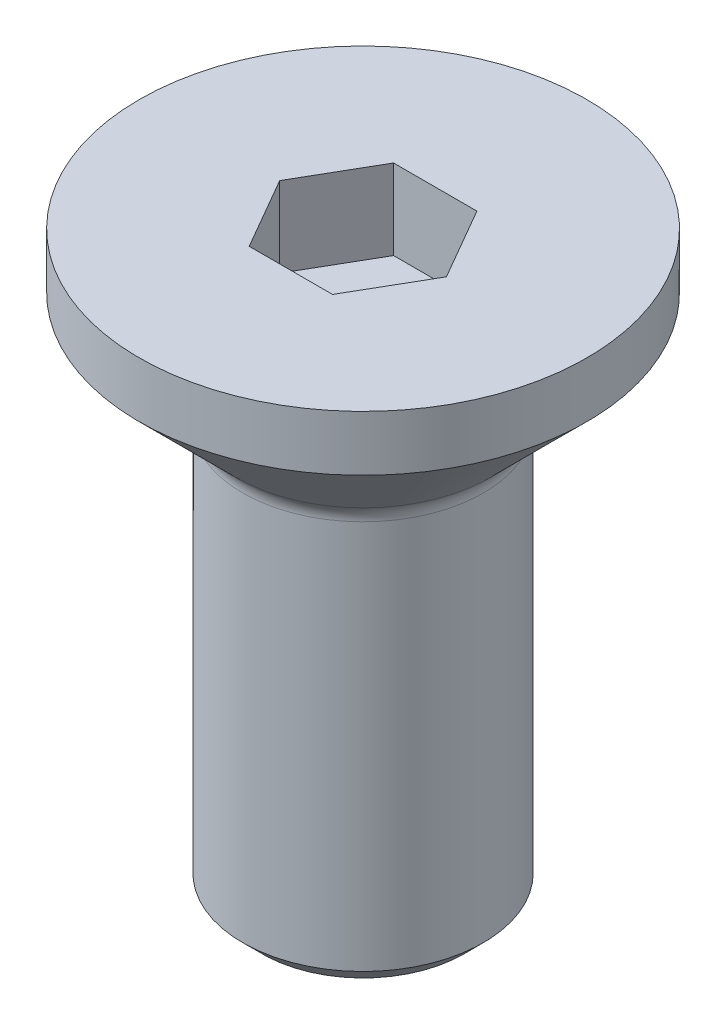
from build123d import *

# Parameters (mm, degrees)
ENL_V_MAT_EXTRU_1_DEPTH = 1.666666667


with BuildPart() as part:
    # Esquisse1 → R_volution1 (revolve)
    with BuildSketch(Plane.XY, mode=Mode.PRIVATE) as r_volution1_sk:
        with BuildLine():
            Line((4.65, -1.15), (2.646446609, -3.153553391))
            ThreePointArc((2.646446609, -3.153553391), (2.538060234, -3.315765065), (2.5, -3.507106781))
            Line((2.5, -3.507106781), (2.5, -11.6))
            Line((2.5, -11.6), (2.1, -12))
            Line((2.1, -12), (0, -12))
            Line((0, -12), (0, 0))
            Line((0, 0), (4.65, 0))
            Line((4.65, 0), (4.65, -1.15))
        make_face()
    revolve(r_volution1_sk.sketch.rotate(Axis((0, 0, 0), (0, -1, 0)), 180), axis=Axis((0, 0, 0), (0, -1, 0)))

    # Esquisse2 → Enl_v. mat.-Extru.1 (cut)
    with BuildSketch(Plane(origin=(0, 0, 0), x_dir=(1, 0, 0), z_dir=(0, 1, 0))):
        Polygon((1.732050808, 0), (0.866025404, 1.5), (-0.866025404, 1.5), (-1.732050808, 0), (-0.866025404, -1.5), (0.866025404, -1.5), align=None)
    extrude(amount=-ENL_V_MAT_EXTRU_1_DEPTH, mode=Mode.SUBTRACT)


solid = part.part
